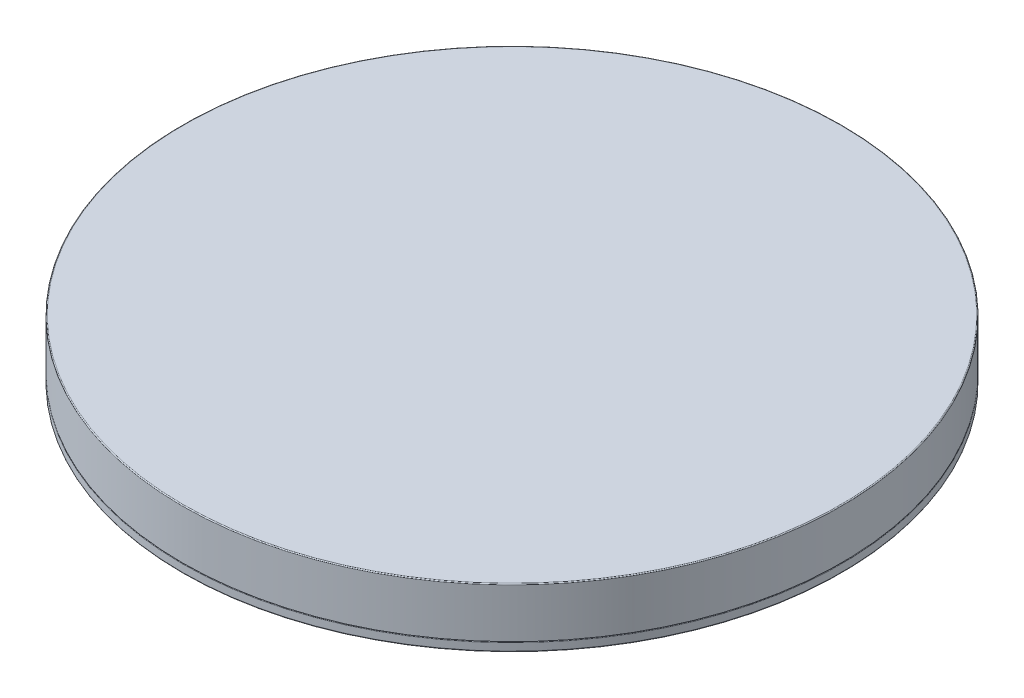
from build123d import *

# Parameters (mm, degrees)
CROQUIS1_R              = 72.5
SALIENTE_EXTRUIR1_DEPTH = 2
REDONDEO1_R             = 0.2
CROQUIS2_R              = 11
CROQUIS2_R_2            = 7.5
SALIENTE_EXTRUIR2_DEPTH = 4
REDONDEO2_R             = 0.2
CROQUIS3_R              = 72.5
SALIENTE_EXTRUIR3_DEPTH = 11
REDONDEO3_R             = 0.2


with BuildPart() as part:
    # Croquis1 → Saliente-Extruir1 (new body)
    with BuildSketch(Plane(origin=(0, 0, 0), x_dir=(1, 0, 0), z_dir=(0, 1, 0))):
        with Locations(Location((0, 0, 0), (0, 0, 270))):
            Circle(CROQUIS1_R)
    extrude(amount=SALIENTE_EXTRUIR1_DEPTH)

    # Redondeo1
    redondeo1_edges = [part.edges().sort_by_distance(p)[0] for p in [
        (0, 0, -72.5),
        (0, 2, -72.5),
    ]]
    fillet(redondeo1_edges, radius=REDONDEO1_R)

    # Croquis2 → Saliente-Extruir2 (add)
    with BuildSketch(Plane.XZ):
        with Locations(Location((0, 0, 0), (0, 0, 90))):
            Circle(CROQUIS2_R)
        with Locations(Location((0, 0, 0), (0, 0, 270))):
            Circle(CROQUIS2_R_2, mode=Mode.SUBTRACT)
    extrude(amount=SALIENTE_EXTRUIR2_DEPTH)

    # Redondeo2
    redondeo2_edges = [part.edges().sort_by_distance(p)[0] for p in [
        (0, 0, -11),
        (0, -4, 7.5),
        (0, -4, -11),
    ]]
    fillet(redondeo2_edges, radius=REDONDEO2_R)


with BuildPart() as body_2:
    # Croquis3 → Saliente-Extruir3 (new body)
    with BuildSketch(Plane(origin=(0, 2, 0), x_dir=(1, 0, 0), z_dir=(0, 1, 0))):
        with Locations(Location((0, 0, 0), (0, 0, 270))):
            Circle(CROQUIS3_R)
    extrude(amount=SALIENTE_EXTRUIR3_DEPTH)

    # Redondeo3
    redondeo3_edges = [body_2.edges().sort_by_distance(p)[0] for p in [
        (0, 13, -72.5),
    ]]
    fillet(redondeo3_edges, radius=REDONDEO3_R)


solid = Compound([part.part, body_2.part])
